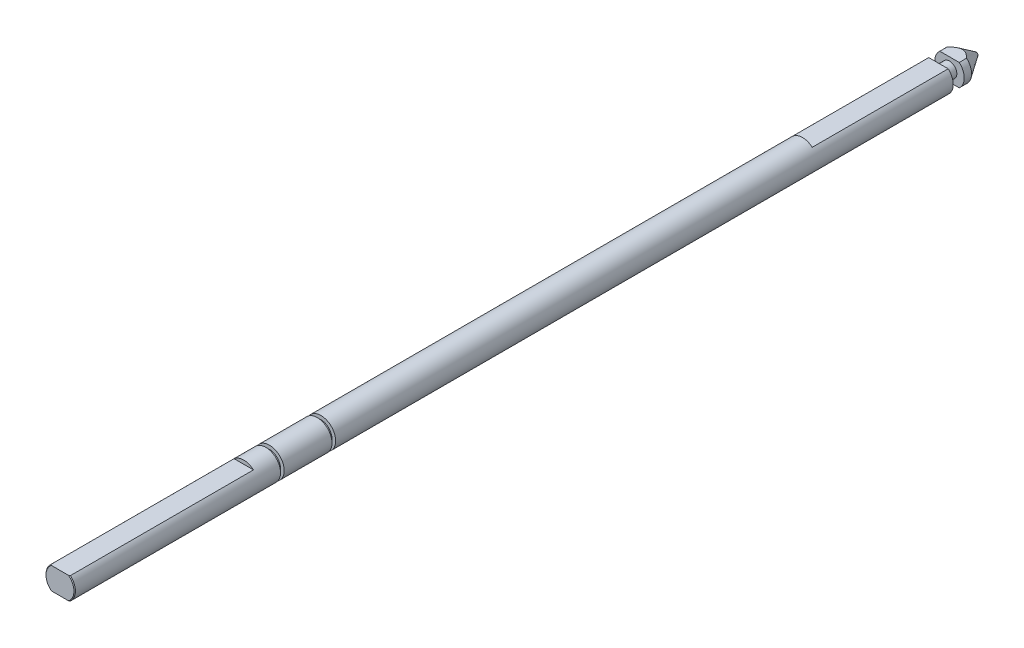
ISO-10303-21;
HEADER;
FILE_DESCRIPTION(('STEP AP214'),'2;1');
FILE_NAME('part.step','',(''),(''),'','','');
FILE_SCHEMA(('AUTOMOTIVE_DESIGN { 1 0 10303 214 1 1 1 1 }'));
ENDSEC;
DATA;
#1=APPLICATION_CONTEXT('core data for automotive mechanical design processes');
#2=APPLICATION_PROTOCOL_DEFINITION('international standard','automotive_design',2000,#1);
#3=PRODUCT_CONTEXT('',#1,'mechanical');
#4=PRODUCT('Part','Part','',(#3));
#5=PRODUCT_RELATED_PRODUCT_CATEGORY('part','',(#4));
#6=PRODUCT_DEFINITION_FORMATION('','',#4);
#7=PRODUCT_DEFINITION_CONTEXT('part definition',#1,'design');
#8=PRODUCT_DEFINITION('design','',#6,#7);
#9=PRODUCT_DEFINITION_SHAPE('','',#8);
#10=(LENGTH_UNIT() NAMED_UNIT(*) SI_UNIT(.MILLI.,.METRE.));
#11=(NAMED_UNIT(*) PLANE_ANGLE_UNIT() SI_UNIT($,.RADIAN.));
#12=(NAMED_UNIT(*) SI_UNIT($,.STERADIAN.) SOLID_ANGLE_UNIT());
#13=UNCERTAINTY_MEASURE_WITH_UNIT(LENGTH_MEASURE(1.E-05),#10,'distance_accuracy_value','');
#14=(GEOMETRIC_REPRESENTATION_CONTEXT(3) GLOBAL_UNCERTAINTY_ASSIGNED_CONTEXT((#13)) GLOBAL_UNIT_ASSIGNED_CONTEXT((#10,
#11,#12)) REPRESENTATION_CONTEXT('',''));
#15=CARTESIAN_POINT('',(0.,0.,0.));
#16=DIRECTION('',(0.,0.,1.));
#17=DIRECTION('',(1.,0.,0.));
#18=AXIS2_PLACEMENT_3D('',#15,#16,#17);
#19=CARTESIAN_POINT('',(0.,0.,125.));
#20=DIRECTION('',(0.,0.,-1.));
#21=DIRECTION('',(-1.,0.,0.));
#22=AXIS2_PLACEMENT_3D('',#19,#20,#21);
#23=CYLINDRICAL_SURFACE('',#22,2.);
#24=CARTESIAN_POINT('',(0.,0.,4.));
#25=DIRECTION('',(0.,0.,-1.));
#26=DIRECTION('',(-1.,0.,0.));
#27=AXIS2_PLACEMENT_3D('',#24,#25,#26);
#28=CIRCLE('',#27,2.);
#29=CARTESIAN_POINT('',(1.32287565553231,1.49999999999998,4.));
#30=VERTEX_POINT('',#29);
#31=CARTESIAN_POINT('',(1.32287565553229,-1.5,4.));
#32=VERTEX_POINT('',#31);
#33=EDGE_CURVE('E286',#30,#32,#28,.T.);
#34=ORIENTED_EDGE('',*,*,#33,.T.);
#35=DIRECTION('',(0.,0.,-1.));
#36=VECTOR('',#35,1.);
#37=CARTESIAN_POINT('',(1.32287565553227,-1.50000000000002,125.));
#38=LINE('',#37,#36);
#39=CARTESIAN_POINT('',(1.32287565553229,-1.5,3.));
#40=VERTEX_POINT('',#39);
#41=EDGE_CURVE('E43',#32,#40,#38,.T.);
#42=ORIENTED_EDGE('',*,*,#41,.T.);
#43=CARTESIAN_POINT('',(0.,0.,3.));
#44=DIRECTION('',(0.,0.,-1.));
#45=DIRECTION('',(-1.,0.,0.));
#46=AXIS2_PLACEMENT_3D('',#43,#44,#45);
#47=CIRCLE('',#46,2.);
#48=CARTESIAN_POINT('',(1.32287565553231,1.49999999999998,3.));
#49=VERTEX_POINT('',#48);
#50=EDGE_CURVE('E306',#49,#40,#47,.T.);
#51=ORIENTED_EDGE('',*,*,#50,.F.);
#52=DIRECTION('',(0.,0.,-1.));
#53=VECTOR('',#52,1.);
#54=CARTESIAN_POINT('',(1.32287565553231,1.49999999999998,125.));
#55=LINE('',#54,#53);
#56=EDGE_CURVE('E292',#49,#30,#55,.F.);
#57=ORIENTED_EDGE('',*,*,#56,.T.);
#58=EDGE_LOOP('',(#34,#42,#51,#57));
#59=FACE_BOUND('',#58,.T.);
#60=ADVANCED_FACE('F34',(#59),#23,.T.);
#61=CARTESIAN_POINT('',(0.,0.,24.));
#62=DIRECTION('',(0.,0.,1.));
#63=DIRECTION('',(0.,-1.,0.));
#64=AXIS2_PLACEMENT_3D('',#61,#62,#63);
#65=CIRCLE('',#64,2.);
#66=CARTESIAN_POINT('',(-1.32287565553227,-1.5,24.));
#67=VERTEX_POINT('',#66);
#68=CARTESIAN_POINT('',(1.32287565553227,-1.5,24.));
#69=VERTEX_POINT('',#68);
#70=EDGE_CURVE('E11',#67,#69,#65,.T.);
#71=ORIENTED_EDGE('',*,*,#70,.T.);
#72=DIRECTION('',(0.,0.,-1.));
#73=VECTOR('',#72,1.);
#74=CARTESIAN_POINT('',(1.32287565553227,-1.50000000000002,125.));
#75=LINE('',#74,#73);
#76=CARTESIAN_POINT('',(1.32287565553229,-1.5,5.50000000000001));
#77=VERTEX_POINT('',#76);
#78=EDGE_CURVE('E141',#69,#77,#75,.T.);
#79=ORIENTED_EDGE('',*,*,#78,.T.);
#80=CARTESIAN_POINT('',(0.,0.,5.50000000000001));
#81=DIRECTION('',(0.,0.,1.));
#82=DIRECTION('',(1.,0.,0.));
#83=AXIS2_PLACEMENT_3D('',#80,#81,#82);
#84=CIRCLE('',#83,2.);
#85=CARTESIAN_POINT('',(1.32287565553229,1.5,5.50000000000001));
#86=VERTEX_POINT('',#85);
#87=EDGE_CURVE('E288',#77,#86,#84,.T.);
#88=ORIENTED_EDGE('',*,*,#87,.T.);
#89=DIRECTION('',(0.,0.,-1.));
#90=VECTOR('',#89,1.);
#91=CARTESIAN_POINT('',(1.32287565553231,1.49999999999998,125.));
#92=LINE('',#91,#90);
#93=CARTESIAN_POINT('',(1.3228756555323,1.5,24.));
#94=VERTEX_POINT('',#93);
#95=EDGE_CURVE('E421',#86,#94,#92,.F.);
#96=ORIENTED_EDGE('',*,*,#95,.T.);
#97=CARTESIAN_POINT('',(0.,0.,24.));
#98=DIRECTION('',(0.,0.,1.));
#99=DIRECTION('',(1.,0.,0.));
#100=AXIS2_PLACEMENT_3D('',#97,#98,#99);
#101=CIRCLE('',#100,2.);
#102=CARTESIAN_POINT('',(-1.3228756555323,1.5,24.));
#103=VERTEX_POINT('',#102);
#104=EDGE_CURVE('E299',#94,#103,#101,.T.);
#105=ORIENTED_EDGE('',*,*,#104,.T.);
#106=DIRECTION('',(0.,0.,-1.));
#107=VECTOR('',#106,1.);
#108=CARTESIAN_POINT('',(-1.32287565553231,1.49999999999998,125.));
#109=LINE('',#108,#107);
#110=CARTESIAN_POINT('',(-1.32287565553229,1.5,5.50000000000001));
#111=VERTEX_POINT('',#110);
#112=EDGE_CURVE('E419',#103,#111,#109,.T.);
#113=ORIENTED_EDGE('',*,*,#112,.T.);
#114=CARTESIAN_POINT('',(-1.32287565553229,-1.5,5.50000000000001));
#115=VERTEX_POINT('',#114);
#116=EDGE_CURVE('E149',#111,#115,#84,.T.);
#117=ORIENTED_EDGE('',*,*,#116,.T.);
#118=DIRECTION('',(0.,0.,-1.));
#119=VECTOR('',#118,1.);
#120=CARTESIAN_POINT('',(-1.32287565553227,-1.50000000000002,125.));
#121=LINE('',#120,#119);
#122=EDGE_CURVE('E50',#115,#67,#121,.F.);
#123=ORIENTED_EDGE('',*,*,#122,.T.);
#124=EDGE_LOOP('',(#71,#79,#88,#96,#105,#113,#117,#123));
#125=FACE_BOUND('',#124,.T.);
#126=CARTESIAN_POINT('',(0.,0.,89.5));
#127=DIRECTION('',(0.,0.,1.));
#128=DIRECTION('',(1.,0.,0.));
#129=AXIS2_PLACEMENT_3D('',#126,#127,#128);
#130=CIRCLE('',#129,2.);
#131=CARTESIAN_POINT('',(2.,0.,89.5));
#132=VERTEX_POINT('',#131);
#133=EDGE_CURVE('E400',#132,#132,#130,.T.);
#134=ORIENTED_EDGE('',*,*,#133,.F.);
#135=EDGE_LOOP('',(#134));
#136=FACE_BOUND('',#135,.T.);
#137=ADVANCED_FACE('F145',(#125,#136),#23,.T.);
#138=CARTESIAN_POINT('',(0.,0.,90.));
#139=DIRECTION('',(0.,0.,-1.));
#140=DIRECTION('',(-1.,0.,0.));
#141=AXIS2_PLACEMENT_3D('',#138,#139,#140);
#142=CIRCLE('',#141,2.);
#143=CARTESIAN_POINT('',(-2.,0.,90.));
#144=VERTEX_POINT('',#143);
#145=EDGE_CURVE('E270',#144,#144,#142,.T.);
#146=ORIENTED_EDGE('',*,*,#145,.F.);
#147=EDGE_LOOP('',(#146));
#148=FACE_BOUND('',#147,.T.);
#149=CARTESIAN_POINT('',(0.,0.,96.5));
#150=DIRECTION('',(0.,0.,1.));
#151=DIRECTION('',(1.,0.,0.));
#152=AXIS2_PLACEMENT_3D('',#149,#150,#151);
#153=CIRCLE('',#152,2.);
#154=CARTESIAN_POINT('',(2.,0.,96.5));
#155=VERTEX_POINT('',#154);
#156=EDGE_CURVE('E273',#155,#155,#153,.T.);
#157=ORIENTED_EDGE('',*,*,#156,.F.);
#158=EDGE_LOOP('',(#157));
#159=FACE_BOUND('',#158,.T.);
#160=ADVANCED_FACE('F225',(#148,#159),#23,.T.);
#161=CARTESIAN_POINT('',(0.,1.5,89.5));
#162=DIRECTION('',(0.,0.,1.));
#163=DIRECTION('',(1.,0.,0.));
#164=AXIS2_PLACEMENT_3D('',#161,#162,#163);
#165=PLANE('',#164);
#166=CARTESIAN_POINT('',(0.,0.,89.5));
#167=DIRECTION('',(0.,0.,1.));
#168=DIRECTION('',(1.,0.,0.));
#169=AXIS2_PLACEMENT_3D('',#166,#167,#168);
#170=CIRCLE('',#169,1.5);
#171=CARTESIAN_POINT('',(1.5,0.,89.5));
#172=VERTEX_POINT('',#171);
#173=EDGE_CURVE('E275',#172,#172,#170,.T.);
#174=ORIENTED_EDGE('',*,*,#173,.F.);
#175=EDGE_LOOP('',(#174));
#176=FACE_BOUND('',#175,.T.);
#177=ORIENTED_EDGE('',*,*,#133,.T.);
#178=EDGE_LOOP('',(#177));
#179=FACE_BOUND('',#178,.T.);
#180=ADVANCED_FACE('F221',(#176,#179),#165,.T.);
#181=CARTESIAN_POINT('',(0.,1.5,90.));
#182=DIRECTION('',(0.,0.,-1.));
#183=DIRECTION('',(-1.,0.,0.));
#184=AXIS2_PLACEMENT_3D('',#181,#182,#183);
#185=PLANE('',#184);
#186=CARTESIAN_POINT('',(0.,0.,90.));
#187=DIRECTION('',(0.,0.,1.));
#188=DIRECTION('',(1.,0.,0.));
#189=AXIS2_PLACEMENT_3D('',#186,#187,#188);
#190=CIRCLE('',#189,1.5);
#191=CARTESIAN_POINT('',(1.5,0.,90.));
#192=VERTEX_POINT('',#191);
#193=EDGE_CURVE('E279',#192,#192,#190,.T.);
#194=ORIENTED_EDGE('',*,*,#193,.T.);
#195=EDGE_LOOP('',(#194));
#196=FACE_BOUND('',#195,.T.);
#197=ORIENTED_EDGE('',*,*,#145,.T.);
#198=EDGE_LOOP('',(#197));
#199=FACE_BOUND('',#198,.T.);
#200=ADVANCED_FACE('F217',(#196,#199),#185,.T.);
#201=CARTESIAN_POINT('',(0.,0.,129.9));
#202=DIRECTION('',(0.,0.,1.));
#203=DIRECTION('',(1.,0.,0.));
#204=AXIS2_PLACEMENT_3D('',#201,#202,#203);
#205=CYLINDRICAL_SURFACE('',#204,1.5);
#206=ORIENTED_EDGE('',*,*,#173,.T.);
#207=EDGE_LOOP('',(#206));
#208=FACE_BOUND('',#207,.T.);
#209=ORIENTED_EDGE('',*,*,#193,.F.);
#210=EDGE_LOOP('',(#209));
#211=FACE_BOUND('',#210,.T.);
#212=ADVANCED_FACE('F213',(#208,#211),#205,.T.);
#213=CARTESIAN_POINT('',(0.,3.36259698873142,96.5));
#214=DIRECTION('',(0.,0.,1.));
#215=DIRECTION('',(1.,0.,0.));
#216=AXIS2_PLACEMENT_3D('',#213,#214,#215);
#217=PLANE('',#216);
#218=CARTESIAN_POINT('',(0.,0.,96.5));
#219=DIRECTION('',(0.,0.,1.));
#220=DIRECTION('',(1.,0.,0.));
#221=AXIS2_PLACEMENT_3D('',#218,#219,#220);
#222=CIRCLE('',#221,1.5);
#223=CARTESIAN_POINT('',(1.5,0.,96.5));
#224=VERTEX_POINT('',#223);
#225=EDGE_CURVE('E282',#224,#224,#222,.T.);
#226=ORIENTED_EDGE('',*,*,#225,.F.);
#227=EDGE_LOOP('',(#226));
#228=FACE_BOUND('',#227,.T.);
#229=ORIENTED_EDGE('',*,*,#156,.T.);
#230=EDGE_LOOP('',(#229));
#231=FACE_BOUND('',#230,.T.);
#232=ADVANCED_FACE('F205',(#228,#231),#217,.T.);
#233=CARTESIAN_POINT('',(0.,3.36259698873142,97.));
#234=DIRECTION('',(0.,0.,-1.));
#235=DIRECTION('',(-1.,0.,0.));
#236=AXIS2_PLACEMENT_3D('',#233,#234,#235);
#237=PLANE('',#236);
#238=CARTESIAN_POINT('',(0.,0.,97.));
#239=DIRECTION('',(0.,0.,1.));
#240=DIRECTION('',(1.,0.,0.));
#241=AXIS2_PLACEMENT_3D('',#238,#239,#240);
#242=CIRCLE('',#241,1.5);
#243=CARTESIAN_POINT('',(1.5,0.,97.));
#244=VERTEX_POINT('',#243);
#245=EDGE_CURVE('E291',#244,#244,#242,.T.);
#246=ORIENTED_EDGE('',*,*,#245,.T.);
#247=EDGE_LOOP('',(#246));
#248=FACE_BOUND('',#247,.T.);
#249=CARTESIAN_POINT('',(0.,0.,97.));
#250=DIRECTION('',(0.,0.,-1.));
#251=DIRECTION('',(-1.,0.,0.));
#252=AXIS2_PLACEMENT_3D('',#249,#250,#251);
#253=CIRCLE('',#252,2.);
#254=CARTESIAN_POINT('',(-2.,0.,97.));
#255=VERTEX_POINT('',#254);
#256=EDGE_CURVE('E276',#255,#255,#253,.T.);
#257=ORIENTED_EDGE('',*,*,#256,.T.);
#258=EDGE_LOOP('',(#257));
#259=FACE_BOUND('',#258,.T.);
#260=ADVANCED_FACE('F201',(#248,#259),#237,.T.);
#261=CARTESIAN_POINT('',(0.,0.,129.9));
#262=DIRECTION('',(0.,0.,1.));
#263=DIRECTION('',(1.,0.,0.));
#264=AXIS2_PLACEMENT_3D('',#261,#262,#263);
#265=CYLINDRICAL_SURFACE('',#264,1.5);
#266=ORIENTED_EDGE('',*,*,#225,.T.);
#267=EDGE_LOOP('',(#266));
#268=FACE_BOUND('',#267,.T.);
#269=ORIENTED_EDGE('',*,*,#245,.F.);
#270=EDGE_LOOP('',(#269));
#271=FACE_BOUND('',#270,.T.);
#272=ADVANCED_FACE('F204',(#268,#271),#265,.T.);
#273=CARTESIAN_POINT('',(0.,0.,125.));
#274=DIRECTION('',(0.,0.,1.));
#275=DIRECTION('',(1.,0.,0.));
#276=AXIS2_PLACEMENT_3D('',#273,#274,#275);
#277=PLANE('',#276);
#278=DIRECTION('',(1.,0.,0.));
#279=VECTOR('',#278,1.);
#280=CARTESIAN_POINT('',(-5.,-1.5,125.));
#281=LINE('',#280,#279);
#282=CARTESIAN_POINT('',(-1.16619037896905,-1.5,125.));
#283=VERTEX_POINT('',#282);
#284=CARTESIAN_POINT('',(1.16619037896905,-1.5,125.));
#285=VERTEX_POINT('',#284);
#286=EDGE_CURVE('E315',#283,#285,#281,.T.);
#287=ORIENTED_EDGE('',*,*,#286,.T.);
#288=CARTESIAN_POINT('',(0.,0.,125.));
#289=DIRECTION('',(0.,0.,1.));
#290=DIRECTION('',(1.,0.,0.));
#291=AXIS2_PLACEMENT_3D('',#288,#289,#290);
#292=CIRCLE('',#291,1.9);
#293=CARTESIAN_POINT('',(1.16619037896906,1.5,125.));
#294=VERTEX_POINT('',#293);
#295=EDGE_CURVE('E342',#285,#294,#292,.T.);
#296=ORIENTED_EDGE('',*,*,#295,.T.);
#297=DIRECTION('',(1.,0.,0.));
#298=VECTOR('',#297,1.);
#299=CARTESIAN_POINT('',(-5.,1.5,125.));
#300=LINE('',#299,#298);
#301=CARTESIAN_POINT('',(-1.16619037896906,1.5,125.));
#302=VERTEX_POINT('',#301);
#303=EDGE_CURVE('E330',#302,#294,#300,.T.);
#304=ORIENTED_EDGE('',*,*,#303,.F.);
#305=EDGE_CURVE('E343',#302,#283,#292,.T.);
#306=ORIENTED_EDGE('',*,*,#305,.T.);
#307=EDGE_LOOP('',(#287,#296,#304,#306));
#308=FACE_BOUND('',#307,.T.);
#309=ADVANCED_FACE('F209',(#308),#277,.T.);
#310=CARTESIAN_POINT('',(-5.,11.5,100.));
#311=DIRECTION('',(0.,0.,-1.));
#312=DIRECTION('',(-1.,0.,0.));
#313=AXIS2_PLACEMENT_3D('',#310,#311,#312);
#314=PLANE('',#313);
#315=DIRECTION('',(1.,0.,0.));
#316=VECTOR('',#315,1.);
#317=CARTESIAN_POINT('',(-5.,1.5,100.));
#318=LINE('',#317,#316);
#319=CARTESIAN_POINT('',(-1.3228756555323,1.5,100.));
#320=VERTEX_POINT('',#319);
#321=CARTESIAN_POINT('',(1.3228756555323,1.5,100.));
#322=VERTEX_POINT('',#321);
#323=EDGE_CURVE('E331',#320,#322,#318,.T.);
#324=ORIENTED_EDGE('',*,*,#323,.T.);
#325=CARTESIAN_POINT('',(0.,0.,100.));
#326=DIRECTION('',(0.,0.,-1.));
#327=DIRECTION('',(-1.,0.,0.));
#328=AXIS2_PLACEMENT_3D('',#325,#326,#327);
#329=CIRCLE('',#328,2.);
#330=EDGE_CURVE('E357',#320,#322,#329,.T.);
#331=ORIENTED_EDGE('',*,*,#330,.F.);
#332=EDGE_LOOP('',(#324,#331));
#333=FACE_BOUND('',#332,.T.);
#334=ADVANCED_FACE('F364',(#333),#314,.F.);
#335=CARTESIAN_POINT('',(-5.,1.5,100.));
#336=DIRECTION('',(0.,-1.,0.));
#337=DIRECTION('',(0.,0.,-1.));
#338=AXIS2_PLACEMENT_3D('',#335,#336,#337);
#339=PLANE('',#338);
#340=CARTESIAN_POINT('',(-4.13743397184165,1.5,122.499050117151));
#341=CARTESIAN_POINT('',(-4.00723225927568,1.5,122.62142077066));
#342=CARTESIAN_POINT('',(-3.87672683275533,1.5,122.743472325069));
#343=CARTESIAN_POINT('',(-3.61473614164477,1.5,122.986706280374));
#344=CARTESIAN_POINT('',(-3.48325024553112,1.5,123.10788800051));
#345=CARTESIAN_POINT('',(-3.21572782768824,1.5,123.352063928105));
#346=CARTESIAN_POINT('',(-3.07966101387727,1.5,123.475025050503));
#347=CARTESIAN_POINT('',(-2.80588908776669,1.5,123.718939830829));
#348=CARTESIAN_POINT('',(-2.66818505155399,1.5,123.839894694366));
#349=CARTESIAN_POINT('',(-2.39036554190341,1.5,124.078869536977));
#350=CARTESIAN_POINT('',(-2.2502514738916,1.5,124.196891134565));
#351=CARTESIAN_POINT('',(-2.037092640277,1.5,124.370559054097));
#352=CARTESIAN_POINT('',(-1.96546717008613,1.5,124.42794441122));
#353=CARTESIAN_POINT('',(-1.82101103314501,1.5,124.541173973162));
#354=CARTESIAN_POINT('',(-1.74818044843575,1.5,124.597018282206));
#355=CARTESIAN_POINT('',(-1.60175753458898,1.5,124.706084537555));
#356=CARTESIAN_POINT('',(-1.52818118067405,1.5,124.759327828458));
#357=CARTESIAN_POINT('',(-1.37907549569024,1.5,124.863096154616));
#358=CARTESIAN_POINT('',(-1.30354539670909,1.5,124.913620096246));
#359=CARTESIAN_POINT('',(-1.15029190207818,1.5,125.010645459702));
#360=CARTESIAN_POINT('',(-1.0725770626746,1.5,125.057160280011));
#361=CARTESIAN_POINT('',(-0.914115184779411,1.5,125.144653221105));
#362=CARTESIAN_POINT('',(-0.833371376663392,1.5,125.185637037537));
#363=CARTESIAN_POINT('',(-0.705122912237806,1.5,125.243033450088));
#364=CARTESIAN_POINT('',(-0.658875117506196,1.5,125.262246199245));
#365=CARTESIAN_POINT('',(-0.565207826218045,1.5,125.297633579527));
#366=CARTESIAN_POINT('',(-0.517788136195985,1.5,125.31380770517));
#367=CARTESIAN_POINT('',(-0.422103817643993,1.5,125.342405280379));
#368=CARTESIAN_POINT('',(-0.373845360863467,1.5,125.354849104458));
#369=CARTESIAN_POINT('',(-0.276431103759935,1.5,125.375483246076));
#370=CARTESIAN_POINT('',(-0.227275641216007,1.5,125.383675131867));
#371=CARTESIAN_POINT('',(-0.127717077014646,1.5,125.395394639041));
#372=CARTESIAN_POINT('',(-0.0773061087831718,1.5,125.398856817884));
#373=CARTESIAN_POINT('',(0.0236044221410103,1.5,125.400662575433));
#374=CARTESIAN_POINT('',(0.0741039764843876,1.5,125.399006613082));
#375=CARTESIAN_POINT('',(0.174855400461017,1.5,125.390680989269));
#376=CARTESIAN_POINT('',(0.225105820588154,1.5,125.383994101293));
#377=CARTESIAN_POINT('',(0.324776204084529,1.5,125.366027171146));
#378=CARTESIAN_POINT('',(0.374195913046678,1.5,125.354745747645));
#379=CARTESIAN_POINT('',(0.489469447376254,1.5,125.323454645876));
#380=CARTESIAN_POINT('',(0.554864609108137,1.5,125.301765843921));
#381=CARTESIAN_POINT('',(0.683468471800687,1.5,125.252703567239));
#382=CARTESIAN_POINT('',(0.746675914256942,1.5,125.22532688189));
#383=CARTESIAN_POINT('',(0.871745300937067,1.5,125.165965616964));
#384=CARTESIAN_POINT('',(0.9335838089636,1.5,125.133932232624));
#385=CARTESIAN_POINT('',(1.02495606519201,1.5,125.083439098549));
#386=CARTESIAN_POINT('',(1.05517882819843,1.5,125.06620321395));
#387=CARTESIAN_POINT('',(1.11520505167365,1.5,125.031018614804));
#388=CARTESIAN_POINT('',(1.14500853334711,1.5,125.013069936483));
#389=CARTESIAN_POINT('',(1.24756406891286,1.5,124.949844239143));
#390=CARTESIAN_POINT('',(1.3193544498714,1.5,124.903005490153));
#391=CARTESIAN_POINT('',(1.4611148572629,1.5,124.806638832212));
#392=CARTESIAN_POINT('',(1.53108434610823,1.5,124.757110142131));
#393=CARTESIAN_POINT('',(1.66963311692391,1.5,124.656023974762));
#394=CARTESIAN_POINT('',(1.73821109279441,1.5,124.604464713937));
#395=CARTESIAN_POINT('',(1.87420899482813,1.5,124.499837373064));
#396=CARTESIAN_POINT('',(1.94162883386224,1.5,124.446769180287));
#397=CARTESIAN_POINT('',(2.14304711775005,1.5,124.285401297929));
#398=CARTESIAN_POINT('',(2.27564470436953,1.5,124.175355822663));
#399=CARTESIAN_POINT('',(2.53829178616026,1.5,123.952432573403));
#400=CARTESIAN_POINT('',(2.66834259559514,1.5,123.839556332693));
#401=CARTESIAN_POINT('',(2.91156653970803,1.5,123.625198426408));
#402=CARTESIAN_POINT('',(3.02493046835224,1.5,123.523932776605));
#403=CARTESIAN_POINT('',(3.25066692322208,1.5,123.320269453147));
#404=CARTESIAN_POINT('',(3.36303929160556,1.5,123.217871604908));
#405=CARTESIAN_POINT('',(3.58609270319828,1.5,123.013083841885));
#406=CARTESIAN_POINT('',(3.69678005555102,1.5,122.910700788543));
#407=CARTESIAN_POINT('',(3.91753069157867,1.5,122.705307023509));
#408=CARTESIAN_POINT('',(4.02759409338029,1.5,122.602296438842));
#409=CARTESIAN_POINT('',(4.13743397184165,1.5,122.499050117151));
#410=B_SPLINE_CURVE_WITH_KNOTS('',3,(#340,#341,#342,#343,#344,#345,#346,#347,#348,#349,#350,
#351,#352,#353,#354,#355,#356,#357,#358,#359,#360,#361,#362,#363,#364,#365,#366,#367,#368,#369,
#370,#371,#372,#373,#374,#375,#376,#377,#378,#379,#380,#381,#382,#383,#384,#385,#386,#387,#388,
#389,#390,#391,#392,#393,#394,#395,#396,#397,#398,#399,#400,#401,#402,#403,#404,#405,#406,#407,
#408,#409),.UNSPECIFIED.,.F.,.F.,(4,2,2,2,2,2,2,2,2,2,2,2,2,2,2,2,2,2,2,2,2,2,2,2,2,2,2,2,2,2,2,
2,2,2,4),(0.,0.536047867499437,1.0724774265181,1.62264777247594,2.17247456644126,
2.72199092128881,2.99731119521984,3.27261280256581,3.54503007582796,3.81755609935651,
4.08913284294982,4.36042775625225,4.51058337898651,4.66076395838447,4.81010866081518,
4.95939824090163,5.1107332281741,5.26205464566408,5.41389657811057,5.56578419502,
5.77211362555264,5.97855984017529,6.18735087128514,6.2917199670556,6.39608376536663,
6.65314355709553,6.91027839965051,7.16764436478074,7.42502960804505,7.94189340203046,
8.45848303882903,8.91449375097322,9.37057578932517,9.82290671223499,10.2751489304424),.UNSPECIFIED.);
#411=CARTESIAN_POINT('',(-1.3228756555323,1.5,124.9));
#412=VERTEX_POINT('',#411);
#413=EDGE_CURVE('E356',#412,#302,#410,.T.);
#414=ORIENTED_EDGE('',*,*,#413,.T.);
#415=ORIENTED_EDGE('',*,*,#303,.T.);
#416=CARTESIAN_POINT('',(1.3228756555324,1.5,124.9));
#417=VERTEX_POINT('',#416);
#418=EDGE_CURVE('E349',#294,#417,#410,.T.);
#419=ORIENTED_EDGE('',*,*,#418,.T.);
#420=DIRECTION('',(0.,0.,-1.));
#421=VECTOR('',#420,1.);
#422=CARTESIAN_POINT('',(1.3228756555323,1.5,125.));
#423=LINE('',#422,#421);
#424=EDGE_CURVE('E334',#322,#417,#423,.F.);
#425=ORIENTED_EDGE('',*,*,#424,.F.);
#426=ORIENTED_EDGE('',*,*,#323,.F.);
#427=DIRECTION('',(0.,0.,-1.));
#428=VECTOR('',#427,1.);
#429=CARTESIAN_POINT('',(-1.3228756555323,1.5,125.));
#430=LINE('',#429,#428);
#431=EDGE_CURVE('E339',#412,#320,#430,.T.);
#432=ORIENTED_EDGE('',*,*,#431,.F.);
#433=EDGE_LOOP('',(#414,#415,#419,#425,#426,#432));
#434=FACE_BOUND('',#433,.T.);
#435=ADVANCED_FACE('F359',(#434),#339,.F.);
#436=CARTESIAN_POINT('',(0.,0.,125.));
#437=DIRECTION('',(0.,0.,-1.));
#438=DIRECTION('',(-1.,0.,0.));
#439=AXIS2_PLACEMENT_3D('',#436,#437,#438);
#440=CONICAL_SURFACE('',#439,1.9,0.785398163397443);
#441=CARTESIAN_POINT('',(4.13743397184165,-1.5,122.499050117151));
#442=CARTESIAN_POINT('',(4.00723225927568,-1.5,122.62142077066));
#443=CARTESIAN_POINT('',(3.87672683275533,-1.5,122.743472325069));
#444=CARTESIAN_POINT('',(3.61473614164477,-1.5,122.986706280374));
#445=CARTESIAN_POINT('',(3.48325024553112,-1.5,123.10788800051));
#446=CARTESIAN_POINT('',(3.21572782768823,-1.5,123.352063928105));
#447=CARTESIAN_POINT('',(3.07966101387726,-1.5,123.475025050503));
#448=CARTESIAN_POINT('',(2.80588908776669,-1.5,123.718939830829));
#449=CARTESIAN_POINT('',(2.66818505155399,-1.5,123.839894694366));
#450=CARTESIAN_POINT('',(2.39036554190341,-1.5,124.078869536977));
#451=CARTESIAN_POINT('',(2.2502514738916,-1.5,124.196891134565));
#452=CARTESIAN_POINT('',(2.03709264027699,-1.5,124.370559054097));
#453=CARTESIAN_POINT('',(1.96546717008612,-1.5,124.42794441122));
#454=CARTESIAN_POINT('',(1.821011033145,-1.5,124.541173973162));
#455=CARTESIAN_POINT('',(1.74818044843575,-1.5,124.597018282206));
#456=CARTESIAN_POINT('',(1.60175753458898,-1.5,124.706084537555));
#457=CARTESIAN_POINT('',(1.52818118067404,-1.5,124.759327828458));
#458=CARTESIAN_POINT('',(1.37907549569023,-1.5,124.863096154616));
#459=CARTESIAN_POINT('',(1.30354539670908,-1.5,124.913620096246));
#460=CARTESIAN_POINT('',(1.15029190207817,-1.5,125.010645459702));
#461=CARTESIAN_POINT('',(1.07257706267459,-1.5,125.057160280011));
#462=CARTESIAN_POINT('',(0.914115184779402,-1.5,125.144653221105));
#463=CARTESIAN_POINT('',(0.833371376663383,-1.5,125.185637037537));
#464=CARTESIAN_POINT('',(0.705122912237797,-1.5,125.243033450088));
#465=CARTESIAN_POINT('',(0.658875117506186,-1.5,125.262246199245));
#466=CARTESIAN_POINT('',(0.565207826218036,-1.5,125.297633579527));
#467=CARTESIAN_POINT('',(0.517788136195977,-1.5,125.31380770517));
#468=CARTESIAN_POINT('',(0.422103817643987,-1.5,125.342405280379));
#469=CARTESIAN_POINT('',(0.373845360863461,-1.5,125.354849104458));
#470=CARTESIAN_POINT('',(0.276431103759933,-1.5,125.375483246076));
#471=CARTESIAN_POINT('',(0.227275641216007,-1.5,125.383675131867));
#472=CARTESIAN_POINT('',(0.127717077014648,-1.5,125.395394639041));
#473=CARTESIAN_POINT('',(0.0773061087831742,-1.5,125.398856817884));
#474=CARTESIAN_POINT('',(-0.0236044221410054,-1.5,125.400662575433));
#475=CARTESIAN_POINT('',(-0.0741039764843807,-1.5,125.399006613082));
#476=CARTESIAN_POINT('',(-0.174855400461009,-1.5,125.390680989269));
#477=CARTESIAN_POINT('',(-0.225105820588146,-1.5,125.383994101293));
#478=CARTESIAN_POINT('',(-0.324776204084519,-1.5,125.366027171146));
#479=CARTESIAN_POINT('',(-0.374195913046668,-1.5,125.354745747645));
#480=CARTESIAN_POINT('',(-0.489469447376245,-1.5,125.323454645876));
#481=CARTESIAN_POINT('',(-0.554864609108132,-1.5,125.301765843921));
#482=CARTESIAN_POINT('',(-0.68346847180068,-1.5,125.252703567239));
#483=CARTESIAN_POINT('',(-0.746675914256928,-1.5,125.22532688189));
#484=CARTESIAN_POINT('',(-0.871745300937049,-1.5,125.165965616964));
#485=CARTESIAN_POINT('',(-0.933583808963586,-1.5,125.133932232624));
#486=CARTESIAN_POINT('',(-1.02495606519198,-1.5,125.083439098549));
#487=CARTESIAN_POINT('',(-1.05517882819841,-1.5,125.06620321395));
#488=CARTESIAN_POINT('',(-1.11520505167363,-1.5,125.031018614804));
#489=CARTESIAN_POINT('',(-1.14500853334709,-1.5,125.013069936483));
#490=CARTESIAN_POINT('',(-1.24756406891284,-1.5,124.949844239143));
#491=CARTESIAN_POINT('',(-1.31935444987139,-1.5,124.903005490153));
#492=CARTESIAN_POINT('',(-1.46111485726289,-1.5,124.806638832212));
#493=CARTESIAN_POINT('',(-1.53108434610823,-1.5,124.757110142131));
#494=CARTESIAN_POINT('',(-1.6696331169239,-1.5,124.656023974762));
#495=CARTESIAN_POINT('',(-1.7382110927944,-1.5,124.604464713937));
#496=CARTESIAN_POINT('',(-1.87420899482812,-1.5,124.499837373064));
#497=CARTESIAN_POINT('',(-1.94162883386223,-1.5,124.446769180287));
#498=CARTESIAN_POINT('',(-2.14304711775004,-1.5,124.285401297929));
#499=CARTESIAN_POINT('',(-2.27564470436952,-1.5,124.175355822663));
#500=CARTESIAN_POINT('',(-2.53829178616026,-1.5,123.952432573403));
#501=CARTESIAN_POINT('',(-2.66834259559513,-1.5,123.839556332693));
#502=CARTESIAN_POINT('',(-2.91156653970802,-1.5,123.625198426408));
#503=CARTESIAN_POINT('',(-3.02493046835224,-1.5,123.523932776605));
#504=CARTESIAN_POINT('',(-3.25066692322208,-1.5,123.320269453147));
#505=CARTESIAN_POINT('',(-3.36303929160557,-1.5,123.217871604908));
#506=CARTESIAN_POINT('',(-3.58609270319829,-1.5,123.013083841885));
#507=CARTESIAN_POINT('',(-3.69678005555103,-1.5,122.910700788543));
#508=CARTESIAN_POINT('',(-3.91753069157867,-1.5,122.705307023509));
#509=CARTESIAN_POINT('',(-4.02759409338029,-1.5,122.602296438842));
#510=CARTESIAN_POINT('',(-4.13743397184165,-1.5,122.499050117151));
#511=B_SPLINE_CURVE_WITH_KNOTS('',3,(#441,#442,#443,#444,#445,#446,#447,#448,#449,#450,#451,
#452,#453,#454,#455,#456,#457,#458,#459,#460,#461,#462,#463,#464,#465,#466,#467,#468,#469,#470,
#471,#472,#473,#474,#475,#476,#477,#478,#479,#480,#481,#482,#483,#484,#485,#486,#487,#488,#489,
#490,#491,#492,#493,#494,#495,#496,#497,#498,#499,#500,#501,#502,#503,#504,#505,#506,#507,#508,
#509,#510),.UNSPECIFIED.,.F.,.F.,(4,2,2,2,2,2,2,2,2,2,2,2,2,2,2,2,2,2,2,2,2,2,2,2,2,2,2,2,2,2,2,
2,2,2,4),(0.,0.536047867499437,1.0724774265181,1.62264777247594,2.17247456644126,
2.72199092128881,2.99731119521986,3.27261280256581,3.54503007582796,3.81755609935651,
4.08913284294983,4.36042775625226,4.51058337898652,4.66076395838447,4.81010866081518,
4.95939824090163,5.11073322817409,5.26205464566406,5.41389657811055,5.56578419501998,
5.77211362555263,5.97855984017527,6.18735087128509,6.29171996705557,6.3960837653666,
6.65314355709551,6.91027839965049,7.16764436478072,7.42502960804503,7.94189340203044,
8.45848303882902,8.91449375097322,9.37057578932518,9.82290671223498,10.2751489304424),.UNSPECIFIED.);
#512=CARTESIAN_POINT('',(-1.32287565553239,-1.5,124.9));
#513=VERTEX_POINT('',#512);
#514=EDGE_CURVE('E385',#283,#513,#511,.T.);
#515=ORIENTED_EDGE('',*,*,#514,.F.);
#516=ORIENTED_EDGE('',*,*,#305,.F.);
#517=ORIENTED_EDGE('',*,*,#413,.F.);
#518=CARTESIAN_POINT('',(0.,0.,124.9));
#519=DIRECTION('',(0.,0.,1.));
#520=DIRECTION('',(1.,0.,0.));
#521=AXIS2_PLACEMENT_3D('',#518,#519,#520);
#522=CIRCLE('',#521,2.);
#523=EDGE_CURVE('E346',#513,#412,#522,.F.);
#524=ORIENTED_EDGE('',*,*,#523,.F.);
#525=EDGE_LOOP('',(#515,#516,#517,#524));
#526=FACE_BOUND('',#525,.T.);
#527=ADVANCED_FACE('F36',(#526),#440,.T.);
#528=CARTESIAN_POINT('',(-5.,-1.5,100.));
#529=DIRECTION('',(0.,0.,-1.));
#530=DIRECTION('',(-1.,0.,0.));
#531=AXIS2_PLACEMENT_3D('',#528,#529,#530);
#532=PLANE('',#531);
#533=DIRECTION('',(1.,0.,0.));
#534=VECTOR('',#533,1.);
#535=CARTESIAN_POINT('',(-5.,-1.5,100.));
#536=LINE('',#535,#534);
#537=CARTESIAN_POINT('',(-1.32287565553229,-1.5,100.));
#538=VERTEX_POINT('',#537);
#539=CARTESIAN_POINT('',(1.32287565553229,-1.5,100.));
#540=VERTEX_POINT('',#539);
#541=EDGE_CURVE('E311',#538,#540,#536,.T.);
#542=ORIENTED_EDGE('',*,*,#541,.F.);
#543=CARTESIAN_POINT('',(0.,0.,100.));
#544=DIRECTION('',(0.,0.,-1.));
#545=DIRECTION('',(-1.,0.,0.));
#546=AXIS2_PLACEMENT_3D('',#543,#544,#545);
#547=CIRCLE('',#546,2.);
#548=EDGE_CURVE('E296',#540,#538,#547,.T.);
#549=ORIENTED_EDGE('',*,*,#548,.F.);
#550=EDGE_LOOP('',(#542,#549));
#551=FACE_BOUND('',#550,.T.);
#552=ADVANCED_FACE('F366',(#551),#532,.F.);
#553=CARTESIAN_POINT('',(-5.,-1.5,125.));
#554=DIRECTION('',(0.,1.,0.));
#555=DIRECTION('',(0.,0.,1.));
#556=AXIS2_PLACEMENT_3D('',#553,#554,#555);
#557=PLANE('',#556);
#558=CARTESIAN_POINT('',(1.32287565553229,-1.5,124.9));
#559=VERTEX_POINT('',#558);
#560=EDGE_CURVE('E381',#559,#285,#511,.T.);
#561=ORIENTED_EDGE('',*,*,#560,.T.);
#562=ORIENTED_EDGE('',*,*,#286,.F.);
#563=ORIENTED_EDGE('',*,*,#514,.T.);
#564=DIRECTION('',(0.,0.,-1.));
#565=VECTOR('',#564,1.);
#566=CARTESIAN_POINT('',(-1.32287565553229,-1.5,125.));
#567=LINE('',#566,#565);
#568=EDGE_CURVE('E323',#538,#513,#567,.F.);
#569=ORIENTED_EDGE('',*,*,#568,.F.);
#570=ORIENTED_EDGE('',*,*,#541,.T.);
#571=DIRECTION('',(0.,0.,-1.));
#572=VECTOR('',#571,1.);
#573=CARTESIAN_POINT('',(1.32287565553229,-1.5,125.));
#574=LINE('',#573,#572);
#575=EDGE_CURVE('E327',#559,#540,#574,.T.);
#576=ORIENTED_EDGE('',*,*,#575,.F.);
#577=EDGE_LOOP('',(#561,#562,#563,#569,#570,#576));
#578=FACE_BOUND('',#577,.T.);
#579=ADVANCED_FACE('F259',(#578),#557,.F.);
#580=ORIENTED_EDGE('',*,*,#560,.F.);
#581=EDGE_CURVE('E347',#417,#559,#522,.F.);
#582=ORIENTED_EDGE('',*,*,#581,.F.);
#583=ORIENTED_EDGE('',*,*,#418,.F.);
#584=ORIENTED_EDGE('',*,*,#295,.F.);
#585=EDGE_LOOP('',(#580,#582,#583,#584));
#586=FACE_BOUND('',#585,.T.);
#587=ADVANCED_FACE('F254',(#586),#440,.T.);
#588=ORIENTED_EDGE('',*,*,#581,.T.);
#589=ORIENTED_EDGE('',*,*,#575,.T.);
#590=ORIENTED_EDGE('',*,*,#548,.T.);
#591=ORIENTED_EDGE('',*,*,#568,.T.);
#592=ORIENTED_EDGE('',*,*,#523,.T.);
#593=ORIENTED_EDGE('',*,*,#431,.T.);
#594=ORIENTED_EDGE('',*,*,#330,.T.);
#595=ORIENTED_EDGE('',*,*,#424,.T.);
#596=EDGE_LOOP('',(#588,#589,#590,#591,#592,#593,#594,#595));
#597=FACE_BOUND('',#596,.T.);
#598=ORIENTED_EDGE('',*,*,#256,.F.);
#599=EDGE_LOOP('',(#598));
#600=FACE_BOUND('',#599,.T.);
#601=ADVANCED_FACE('F199',(#597,#600),#23,.T.);
#602=CARTESIAN_POINT('',(0.,11.,5.5));
#603=DIRECTION('',(0.,0.,1.));
#604=DIRECTION('',(1.,0.,0.));
#605=AXIS2_PLACEMENT_3D('',#602,#603,#604);
#606=PLANE('',#605);
#607=CARTESIAN_POINT('',(0.,0.,5.5));
#608=DIRECTION('',(0.,0.,-1.));
#609=DIRECTION('',(-1.,0.,0.));
#610=AXIS2_PLACEMENT_3D('',#607,#608,#609);
#611=CIRCLE('',#610,1.);
#612=CARTESIAN_POINT('',(-1.,0.,5.5));
#613=VERTEX_POINT('',#612);
#614=EDGE_CURVE('E416',#613,#613,#611,.T.);
#615=ORIENTED_EDGE('',*,*,#614,.F.);
#616=EDGE_LOOP('',(#615));
#617=FACE_BOUND('',#616,.T.);
#618=ORIENTED_EDGE('',*,*,#87,.F.);
#619=DIRECTION('',(-1.,0.,0.));
#620=VECTOR('',#619,1.);
#621=CARTESIAN_POINT('',(0.,-1.5,5.5));
#622=LINE('',#621,#620);
#623=EDGE_CURVE('E150',#77,#115,#622,.T.);
#624=ORIENTED_EDGE('',*,*,#623,.T.);
#625=ORIENTED_EDGE('',*,*,#116,.F.);
#626=DIRECTION('',(1.,0.,0.));
#627=VECTOR('',#626,1.);
#628=CARTESIAN_POINT('',(0.,1.5,5.5));
#629=LINE('',#628,#627);
#630=EDGE_CURVE('E423',#111,#86,#629,.T.);
#631=ORIENTED_EDGE('',*,*,#630,.T.);
#632=EDGE_LOOP('',(#618,#624,#625,#631));
#633=FACE_BOUND('',#632,.T.);
#634=ADVANCED_FACE('F195',(#617,#633),#606,.F.);
#635=CARTESIAN_POINT('',(0.,11.,4.));
#636=DIRECTION('',(0.,0.,-1.));
#637=DIRECTION('',(-1.,0.,0.));
#638=AXIS2_PLACEMENT_3D('',#635,#636,#637);
#639=PLANE('',#638);
#640=CARTESIAN_POINT('',(0.,0.,4.));
#641=DIRECTION('',(0.,0.,-1.));
#642=DIRECTION('',(-1.,0.,0.));
#643=AXIS2_PLACEMENT_3D('',#640,#641,#642);
#644=CIRCLE('',#643,1.);
#645=CARTESIAN_POINT('',(-1.,0.,4.));
#646=VERTEX_POINT('',#645);
#647=EDGE_CURVE('E413',#646,#646,#644,.T.);
#648=ORIENTED_EDGE('',*,*,#647,.T.);
#649=EDGE_LOOP('',(#648));
#650=FACE_BOUND('',#649,.T.);
#651=CARTESIAN_POINT('',(-1.32287565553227,-1.50000000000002,4.));
#652=VERTEX_POINT('',#651);
#653=CARTESIAN_POINT('',(-1.32287565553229,1.5,4.));
#654=VERTEX_POINT('',#653);
#655=EDGE_CURVE('E289',#652,#654,#28,.T.);
#656=ORIENTED_EDGE('',*,*,#655,.F.);
#657=DIRECTION('',(1.,0.,0.));
#658=VECTOR('',#657,1.);
#659=CARTESIAN_POINT('',(0.,-1.5,4.));
#660=LINE('',#659,#658);
#661=EDGE_CURVE('E58',#652,#32,#660,.T.);
#662=ORIENTED_EDGE('',*,*,#661,.T.);
#663=ORIENTED_EDGE('',*,*,#33,.F.);
#664=DIRECTION('',(-1.,0.,0.));
#665=VECTOR('',#664,1.);
#666=CARTESIAN_POINT('',(0.,1.5,4.));
#667=LINE('',#666,#665);
#668=EDGE_CURVE('E168',#30,#654,#667,.T.);
#669=ORIENTED_EDGE('',*,*,#668,.T.);
#670=EDGE_LOOP('',(#656,#662,#663,#669));
#671=FACE_BOUND('',#670,.T.);
#672=ADVANCED_FACE('F191',(#650,#671),#639,.F.);
#673=CARTESIAN_POINT('',(0.,0.,1.58383652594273));
#674=DIRECTION('',(0.,0.,-1.));
#675=DIRECTION('',(-1.,0.,0.));
#676=AXIS2_PLACEMENT_3D('',#673,#674,#675);
#677=CYLINDRICAL_SURFACE('',#676,1.);
#678=ORIENTED_EDGE('',*,*,#647,.F.);
#679=EDGE_LOOP('',(#678));
#680=FACE_BOUND('',#679,.T.);
#681=ORIENTED_EDGE('',*,*,#614,.T.);
#682=EDGE_LOOP('',(#681));
#683=FACE_BOUND('',#682,.T.);
#684=ADVANCED_FACE('F187',(#680,#683),#677,.T.);
#685=CARTESIAN_POINT('',(0.,0.,0.5));
#686=DIRECTION('',(0.,0.,1.));
#687=DIRECTION('',(1.,0.,0.));
#688=AXIS2_PLACEMENT_3D('',#685,#686,#687);
#689=PLANE('',#688);
#690=CARTESIAN_POINT('',(0.,0.,0.5));
#691=DIRECTION('',(0.,0.,1.));
#692=DIRECTION('',(1.,0.,0.));
#693=AXIS2_PLACEMENT_3D('',#690,#691,#692);
#694=CIRCLE('',#693,0.25);
#695=CARTESIAN_POINT('',(0.25,0.,0.5));
#696=VERTEX_POINT('',#695);
#697=EDGE_CURVE('E320',#696,#696,#694,.T.);
#698=ORIENTED_EDGE('',*,*,#697,.F.);
#699=EDGE_LOOP('',(#698));
#700=FACE_BOUND('',#699,.T.);
#701=ADVANCED_FACE('F190',(#700),#689,.F.);
#702=CARTESIAN_POINT('',(0.,0.,0.5));
#703=DIRECTION('',(0.,0.,-1.));
#704=DIRECTION('',(-1.,0.,0.));
#705=AXIS2_PLACEMENT_3D('',#702,#703,#704);
#706=CYLINDRICAL_SURFACE('',#705,0.25);
#707=ORIENTED_EDGE('',*,*,#697,.T.);
#708=EDGE_LOOP('',(#707));
#709=FACE_BOUND('',#708,.T.);
#710=CARTESIAN_POINT('',(0.,0.,0.375000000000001));
#711=DIRECTION('',(0.,0.,1.));
#712=DIRECTION('',(1.,0.,0.));
#713=AXIS2_PLACEMENT_3D('',#710,#711,#712);
#714=CIRCLE('',#713,0.25);
#715=CARTESIAN_POINT('',(0.25,0.,0.375000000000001));
#716=VERTEX_POINT('',#715);
#717=EDGE_CURVE('E317',#716,#716,#714,.F.);
#718=ORIENTED_EDGE('',*,*,#717,.T.);
#719=EDGE_LOOP('',(#718));
#720=FACE_BOUND('',#719,.T.);
#721=ADVANCED_FACE('F228',(#709,#720),#706,.F.);
#722=CARTESIAN_POINT('',(0.,0.,3.));
#723=DIRECTION('',(0.,0.,1.));
#724=DIRECTION('',(1.,0.,0.));
#725=AXIS2_PLACEMENT_3D('',#722,#723,#724);
#726=CONICAL_SURFACE('',#725,2.,0.588002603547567);
#727=ORIENTED_EDGE('',*,*,#50,.T.);
#728=CARTESIAN_POINT('',(-2.8596139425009,-1.5,4.84372086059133));
#729=CARTESIAN_POINT('',(-2.79789469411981,-1.5,4.76174856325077));
#730=CARTESIAN_POINT('',(-2.73591062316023,-1.5,4.67997386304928));
#731=CARTESIAN_POINT('',(-2.61127538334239,-1.5,4.51692213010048));
#732=CARTESIAN_POINT('',(-2.54862415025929,-1.5,4.43564514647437));
#733=CARTESIAN_POINT('',(-2.42228518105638,-1.5,4.27339406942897));
#734=CARTESIAN_POINT('',(-2.35859437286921,-1.5,4.19242236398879));
#735=CARTESIAN_POINT('',(-2.23023341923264,-1.5,4.03126392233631));
#736=CARTESIAN_POINT('',(-2.1655633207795,-1.5,3.9510771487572));
#737=CARTESIAN_POINT('',(-2.03230950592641,-1.5,3.78841900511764));
#738=CARTESIAN_POINT('',(-1.9636743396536,-1.5,3.70598967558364));
#739=CARTESIAN_POINT('',(-1.82470941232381,-1.5,3.54257333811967));
#740=CARTESIAN_POINT('',(-1.75437974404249,-1.5,3.46158625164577));
#741=CARTESIAN_POINT('',(-1.61161070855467,-1.5,3.3017159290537));
#742=CARTESIAN_POINT('',(-1.53917485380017,-1.5,3.22282956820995));
#743=CARTESIAN_POINT('',(-1.3913567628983,-1.5,3.0678806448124));
#744=CARTESIAN_POINT('',(-1.31597553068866,-1.5,2.99181713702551));
#745=CARTESIAN_POINT('',(-1.19487304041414,-1.5,2.87616822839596));
#746=CARTESIAN_POINT('',(-1.15054155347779,-1.5,2.83513099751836));
#747=CARTESIAN_POINT('',(-1.0602842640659,-1.5,2.75480990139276));
#748=CARTESIAN_POINT('',(-1.01435799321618,-1.5,2.715526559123));
#749=CARTESIAN_POINT('',(-0.920767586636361,-1.5,2.63943373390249));
#750=CARTESIAN_POINT('',(-0.873110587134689,-1.5,2.60261555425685));
#751=CARTESIAN_POINT('',(-0.77553869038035,-1.5,2.5321288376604));
#752=CARTESIAN_POINT('',(-0.725624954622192,-1.5,2.4984587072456));
#753=CARTESIAN_POINT('',(-0.612730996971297,-1.5,2.42901365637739));
#754=CARTESIAN_POINT('',(-0.549150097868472,-1.5,2.39419079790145));
#755=CARTESIAN_POINT('',(-0.417754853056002,-1.5,2.33376186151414));
#756=CARTESIAN_POINT('',(-0.349951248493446,-1.5,2.30813343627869));
#757=CARTESIAN_POINT('',(-0.223840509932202,-1.5,2.27339435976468));
#758=CARTESIAN_POINT('',(-0.166158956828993,-1.5,2.2620779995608));
#759=CARTESIAN_POINT('',(-0.0496898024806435,-1.5,2.24955463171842));
#760=CARTESIAN_POINT('',(0.00909711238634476,-1.5,2.24834154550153));
#761=CARTESIAN_POINT('',(0.125884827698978,-1.5,2.25621118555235));
#762=CARTESIAN_POINT('',(0.183886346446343,-1.5,2.26528375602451));
#763=CARTESIAN_POINT('',(0.297736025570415,-1.5,2.29233735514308));
#764=CARTESIAN_POINT('',(0.353582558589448,-1.5,2.31032497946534));
#765=CARTESIAN_POINT('',(0.454667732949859,-1.5,2.35011823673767));
#766=CARTESIAN_POINT('',(0.500279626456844,-1.5,2.37100728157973));
#767=CARTESIAN_POINT('',(0.589515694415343,-1.5,2.41670836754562));
#768=CARTESIAN_POINT('',(0.633138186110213,-1.5,2.44152365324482));
#769=CARTESIAN_POINT('',(0.718731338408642,-1.5,2.49426302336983));
#770=CARTESIAN_POINT('',(0.760692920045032,-1.5,2.52220165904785));
#771=CARTESIAN_POINT('',(0.842952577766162,-1.5,2.58037391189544));
#772=CARTESIAN_POINT('',(0.883251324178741,-1.5,2.61060659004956));
#773=CARTESIAN_POINT('',(0.998286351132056,-1.5,2.70100972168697));
#774=CARTESIAN_POINT('',(1.07118347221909,-1.5,2.76351289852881));
#775=CARTESIAN_POINT('',(1.21326067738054,-1.5,2.89263786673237));
#776=CARTESIAN_POINT('',(1.2824376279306,-1.5,2.95926303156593));
#777=CARTESIAN_POINT('',(1.4181477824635,-1.5,3.09545525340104));
#778=CARTESIAN_POINT('',(1.48467428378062,-1.5,3.16502895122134));
#779=CARTESIAN_POINT('',(1.61559482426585,-1.5,3.30615750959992));
#780=CARTESIAN_POINT('',(1.67998858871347,-1.5,3.377712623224));
#781=CARTESIAN_POINT('',(1.80767188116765,-1.5,3.52290291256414));
#782=CARTESIAN_POINT('',(1.87094694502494,-1.5,3.59655076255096));
#783=CARTESIAN_POINT('',(1.99617413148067,-1.5,3.74496864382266));
#784=CARTESIAN_POINT('',(2.05812615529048,-1.5,3.8197387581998));
#785=CARTESIAN_POINT('',(2.18086315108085,-1.5,3.97001850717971));
#786=CARTESIAN_POINT('',(2.24164991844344,-1.5,4.04552667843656));
#787=CARTESIAN_POINT('',(2.36235727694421,-1.5,4.19722680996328));
#788=CARTESIAN_POINT('',(2.42227789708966,-1.5,4.27341874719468));
#789=CARTESIAN_POINT('',(2.60465061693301,-1.5,4.5075299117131));
#790=CARTESIAN_POINT('',(2.72595554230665,-1.5,4.66634246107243));
#791=CARTESIAN_POINT('',(2.96648647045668,-1.5,4.98553643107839));
#792=CARTESIAN_POINT('',(3.08571238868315,-1.5,5.14591791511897));
#793=CARTESIAN_POINT('',(3.32266227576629,-1.5,5.46781602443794));
#794=CARTESIAN_POINT('',(3.44038605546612,-1.5,5.62933278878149));
#795=CARTESIAN_POINT('',(3.67469501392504,-1.5,5.95319076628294));
#796=CARTESIAN_POINT('',(3.79128018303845,-1.5,6.11553198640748));
#797=CARTESIAN_POINT('',(4.14001557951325,-1.5,6.60387084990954));
#798=CARTESIAN_POINT('',(4.37086380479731,-1.5,6.93079771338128));
#799=CARTESIAN_POINT('',(4.83037921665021,-1.5,7.58613944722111));
#800=CARTESIAN_POINT('',(5.05904656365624,-1.5,7.91455420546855));
#801=CARTESIAN_POINT('',(5.49953113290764,-1.5,8.55019525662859));
#802=CARTESIAN_POINT('',(5.71144385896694,-1.5,8.85735540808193));
#803=CARTESIAN_POINT('',(6.13435714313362,-1.5,9.47231324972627));
#804=CARTESIAN_POINT('',(6.34535767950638,-1.5,9.78011095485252));
#805=CARTESIAN_POINT('',(6.76632329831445,-1.5,10.3956517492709));
#806=CARTESIAN_POINT('',(6.97628952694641,-1.5,10.7033940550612));
#807=CARTESIAN_POINT('',(7.39568854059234,-1.5,11.3192294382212));
#808=CARTESIAN_POINT('',(7.60512134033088,-1.5,11.6273225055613));
#809=CARTESIAN_POINT('',(7.81436548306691,-1.5,11.9355432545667));
#810=B_SPLINE_CURVE_WITH_KNOTS('',3,(#728,#729,#730,#731,#732,#733,#734,#735,#736,#737,#738,
#739,#740,#741,#742,#743,#744,#745,#746,#747,#748,#749,#750,#751,#752,#753,#754,#755,#756,#757,
#758,#759,#760,#761,#762,#763,#764,#765,#766,#767,#768,#769,#770,#771,#772,#773,#774,#775,#776,
#777,#778,#779,#780,#781,#782,#783,#784,#785,#786,#787,#788,#789,#790,#791,#792,#793,#794,#795,
#796,#797,#798,#799,#800,#801,#802,#803,#804,#805,#806,#807,#808,#809),.UNSPECIFIED.,.F.,.F.,(4,
2,2,2,2,2,2,2,2,2,2,2,2,2,2,2,2,2,2,2,2,2,2,2,2,2,2,2,2,2,2,2,2,2,2,2,2,2,2,2,4),(0.,
0.307830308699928,0.615690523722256,0.92474166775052,1.23377802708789,1.55555052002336,
1.87730543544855,2.19855148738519,2.51968898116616,2.7008831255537,2.8821309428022,
3.06270139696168,3.24317995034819,3.46016776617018,3.67662455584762,3.85219247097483,
4.02765474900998,4.20294393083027,4.37836299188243,4.52864267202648,4.67904719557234,
4.83018418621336,4.98125964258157,5.26905621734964,5.55709152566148,5.84581416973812,
6.13457386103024,6.42584359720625,6.7171350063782,7.00793413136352,7.29872349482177,
7.89821655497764,8.49773393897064,9.09732608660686,9.69692330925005,10.8975515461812,
12.0980907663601,13.2175923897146,14.3371205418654,15.4547604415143,16.5723691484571),.UNSPECIFIED.);
#811=CARTESIAN_POINT('',(-1.32287565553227,-1.50000000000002,3.));
#812=VERTEX_POINT('',#811);
#813=EDGE_CURVE('E142',#40,#812,#810,.F.);
#814=ORIENTED_EDGE('',*,*,#813,.T.);
#815=CARTESIAN_POINT('',(-1.3228756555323,1.5,3.));
#816=VERTEX_POINT('',#815);
#817=EDGE_CURVE('E312',#812,#816,#47,.T.);
#818=ORIENTED_EDGE('',*,*,#817,.T.);
#819=CARTESIAN_POINT('',(-2.8596139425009,1.5,4.84372086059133));
#820=CARTESIAN_POINT('',(-2.79789469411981,1.5,4.76174856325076));
#821=CARTESIAN_POINT('',(-2.73591062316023,1.5,4.67997386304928));
#822=CARTESIAN_POINT('',(-2.61127538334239,1.5,4.51692213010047));
#823=CARTESIAN_POINT('',(-2.54862415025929,1.5,4.43564514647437));
#824=CARTESIAN_POINT('',(-2.42228518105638,1.5,4.27339406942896));
#825=CARTESIAN_POINT('',(-2.35859437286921,1.5,4.19242236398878));
#826=CARTESIAN_POINT('',(-2.23023341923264,1.5,4.03126392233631));
#827=CARTESIAN_POINT('',(-2.1655633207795,1.5,3.9510771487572));
#828=CARTESIAN_POINT('',(-2.03230950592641,1.5,3.78841900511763));
#829=CARTESIAN_POINT('',(-1.9636743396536,1.5,3.70598967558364));
#830=CARTESIAN_POINT('',(-1.82470941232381,1.5,3.54257333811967));
#831=CARTESIAN_POINT('',(-1.75437974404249,1.5,3.46158625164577));
#832=CARTESIAN_POINT('',(-1.61161070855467,1.5,3.3017159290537));
#833=CARTESIAN_POINT('',(-1.53917485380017,1.5,3.22282956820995));
#834=CARTESIAN_POINT('',(-1.3913567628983,1.5,3.0678806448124));
#835=CARTESIAN_POINT('',(-1.31597553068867,1.5,2.99181713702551));
#836=CARTESIAN_POINT('',(-1.19487304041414,1.5,2.87616822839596));
#837=CARTESIAN_POINT('',(-1.15054155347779,1.5,2.83513099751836));
#838=CARTESIAN_POINT('',(-1.0602842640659,1.5,2.75480990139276));
#839=CARTESIAN_POINT('',(-1.01435799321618,1.5,2.715526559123));
#840=CARTESIAN_POINT('',(-0.920767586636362,1.5,2.63943373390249));
#841=CARTESIAN_POINT('',(-0.873110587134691,1.5,2.60261555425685));
#842=CARTESIAN_POINT('',(-0.775538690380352,1.5,2.5321288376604));
#843=CARTESIAN_POINT('',(-0.725624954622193,1.5,2.4984587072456));
#844=CARTESIAN_POINT('',(-0.612730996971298,1.5,2.42901365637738));
#845=CARTESIAN_POINT('',(-0.549150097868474,1.5,2.39419079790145));
#846=CARTESIAN_POINT('',(-0.417754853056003,1.5,2.33376186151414));
#847=CARTESIAN_POINT('',(-0.349951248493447,1.5,2.30813343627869));
#848=CARTESIAN_POINT('',(-0.223840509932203,1.5,2.27339435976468));
#849=CARTESIAN_POINT('',(-0.166158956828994,1.5,2.2620779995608));
#850=CARTESIAN_POINT('',(-0.0496898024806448,1.5,2.24955463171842));
#851=CARTESIAN_POINT('',(0.00909711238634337,1.5,2.24834154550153));
#852=CARTESIAN_POINT('',(0.125884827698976,1.5,2.25621118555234));
#853=CARTESIAN_POINT('',(0.183886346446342,1.5,2.2652837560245));
#854=CARTESIAN_POINT('',(0.297736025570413,1.5,2.29233735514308));
#855=CARTESIAN_POINT('',(0.353582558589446,1.5,2.31032497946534));
#856=CARTESIAN_POINT('',(0.454667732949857,1.5,2.35011823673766));
#857=CARTESIAN_POINT('',(0.500279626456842,1.5,2.37100728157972));
#858=CARTESIAN_POINT('',(0.589515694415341,1.5,2.41670836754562));
#859=CARTESIAN_POINT('',(0.63313818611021,1.5,2.44152365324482));
#860=CARTESIAN_POINT('',(0.71873133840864,1.5,2.49426302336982));
#861=CARTESIAN_POINT('',(0.760692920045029,1.5,2.52220165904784));
#862=CARTESIAN_POINT('',(0.842952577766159,1.5,2.58037391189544));
#863=CARTESIAN_POINT('',(0.883251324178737,1.5,2.61060659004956));
#864=CARTESIAN_POINT('',(0.998286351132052,1.5,2.70100972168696));
#865=CARTESIAN_POINT('',(1.07118347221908,1.5,2.76351289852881));
#866=CARTESIAN_POINT('',(1.21326067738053,1.5,2.89263786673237));
#867=CARTESIAN_POINT('',(1.28243762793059,1.5,2.95926303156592));
#868=CARTESIAN_POINT('',(1.41814778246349,1.5,3.09545525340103));
#869=CARTESIAN_POINT('',(1.48467428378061,1.5,3.16502895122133));
#870=CARTESIAN_POINT('',(1.61559482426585,1.5,3.30615750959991));
#871=CARTESIAN_POINT('',(1.67998858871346,1.5,3.37771262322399));
#872=CARTESIAN_POINT('',(1.80767188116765,1.5,3.52290291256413));
#873=CARTESIAN_POINT('',(1.87094694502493,1.5,3.59655076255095));
#874=CARTESIAN_POINT('',(1.99617413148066,1.5,3.74496864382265));
#875=CARTESIAN_POINT('',(2.05812615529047,1.5,3.81973875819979));
#876=CARTESIAN_POINT('',(2.18086315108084,1.5,3.97001850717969));
#877=CARTESIAN_POINT('',(2.24164991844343,1.5,4.04552667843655));
#878=CARTESIAN_POINT('',(2.3623572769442,1.5,4.19722680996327));
#879=CARTESIAN_POINT('',(2.42227789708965,1.5,4.27341874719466));
#880=CARTESIAN_POINT('',(2.604650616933,1.5,4.50752991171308));
#881=CARTESIAN_POINT('',(2.72595554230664,1.5,4.66634246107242));
#882=CARTESIAN_POINT('',(2.96648647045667,1.5,4.98553643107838));
#883=CARTESIAN_POINT('',(3.08571238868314,1.5,5.14591791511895));
#884=CARTESIAN_POINT('',(3.32266227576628,1.5,5.46781602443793));
#885=CARTESIAN_POINT('',(3.44038605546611,1.5,5.62933278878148));
#886=CARTESIAN_POINT('',(3.67469501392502,1.5,5.95319076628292));
#887=CARTESIAN_POINT('',(3.79128018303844,1.5,6.11553198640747));
#888=CARTESIAN_POINT('',(4.14001557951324,1.5,6.60387084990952));
#889=CARTESIAN_POINT('',(4.3708638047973,1.5,6.93079771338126));
#890=CARTESIAN_POINT('',(4.8303792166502,1.5,7.58613944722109));
#891=CARTESIAN_POINT('',(5.05904656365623,1.5,7.91455420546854));
#892=CARTESIAN_POINT('',(5.49953113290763,1.5,8.55019525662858));
#893=CARTESIAN_POINT('',(5.71144385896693,1.5,8.85735540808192));
#894=CARTESIAN_POINT('',(6.13435714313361,1.5,9.47231324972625));
#895=CARTESIAN_POINT('',(6.34535767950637,1.5,9.7801109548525));
#896=CARTESIAN_POINT('',(6.76632329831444,1.5,10.3956517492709));
#897=CARTESIAN_POINT('',(6.9762895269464,1.5,10.7033940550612));
#898=CARTESIAN_POINT('',(7.39568854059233,1.5,11.3192294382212));
#899=CARTESIAN_POINT('',(7.60512134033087,1.5,11.6273225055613));
#900=CARTESIAN_POINT('',(7.8143654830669,1.5,11.9355432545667));
#901=B_SPLINE_CURVE_WITH_KNOTS('',3,(#819,#820,#821,#822,#823,#824,#825,#826,#827,#828,#829,
#830,#831,#832,#833,#834,#835,#836,#837,#838,#839,#840,#841,#842,#843,#844,#845,#846,#847,#848,
#849,#850,#851,#852,#853,#854,#855,#856,#857,#858,#859,#860,#861,#862,#863,#864,#865,#866,#867,
#868,#869,#870,#871,#872,#873,#874,#875,#876,#877,#878,#879,#880,#881,#882,#883,#884,#885,#886,
#887,#888,#889,#890,#891,#892,#893,#894,#895,#896,#897,#898,#899,#900),.UNSPECIFIED.,.F.,.F.,(4,
2,2,2,2,2,2,2,2,2,2,2,2,2,2,2,2,2,2,2,2,2,2,2,2,2,2,2,2,2,2,2,2,2,2,2,2,2,2,2,4),(0.,
0.307830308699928,0.615690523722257,0.924741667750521,1.23377802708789,1.55555052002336,
1.87730543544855,2.19855148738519,2.51968898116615,2.7008831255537,2.8821309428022,
3.06270139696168,3.24317995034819,3.46016776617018,3.67662455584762,3.85219247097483,
4.02765474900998,4.20294393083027,4.37836299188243,4.52864267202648,4.67904719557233,
4.83018418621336,4.98125964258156,5.26905621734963,5.55709152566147,5.84581416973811,
6.13457386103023,6.42584359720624,6.71713500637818,7.0079341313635,7.29872349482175,
7.89821655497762,8.49773393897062,9.09732608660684,9.69692330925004,10.8975515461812,
12.09809076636,13.2175923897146,14.3371205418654,15.4547604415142,16.572369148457),.UNSPECIFIED.);
#902=EDGE_CURVE('E159',#816,#49,#901,.T.);
#903=ORIENTED_EDGE('',*,*,#902,.T.);
#904=EDGE_LOOP('',(#727,#814,#818,#903));
#905=FACE_BOUND('',#904,.T.);
#906=ORIENTED_EDGE('',*,*,#717,.F.);
#907=EDGE_LOOP('',(#906));
#908=FACE_BOUND('',#907,.T.);
#909=ADVANCED_FACE('F170',(#905,#908),#726,.T.);
#910=ORIENTED_EDGE('',*,*,#817,.F.);
#911=DIRECTION('',(0.,0.,-1.));
#912=VECTOR('',#911,1.);
#913=CARTESIAN_POINT('',(-1.32287565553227,-1.50000000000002,125.));
#914=LINE('',#913,#912);
#915=EDGE_CURVE('E302',#812,#652,#914,.F.);
#916=ORIENTED_EDGE('',*,*,#915,.T.);
#917=ORIENTED_EDGE('',*,*,#655,.T.);
#918=DIRECTION('',(0.,0.,-1.));
#919=VECTOR('',#918,1.);
#920=CARTESIAN_POINT('',(-1.32287565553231,1.49999999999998,125.));
#921=LINE('',#920,#919);
#922=EDGE_CURVE('E295',#654,#816,#921,.T.);
#923=ORIENTED_EDGE('',*,*,#922,.T.);
#924=EDGE_LOOP('',(#910,#916,#917,#923));
#925=FACE_BOUND('',#924,.T.);
#926=ADVANCED_FACE('F235',(#925),#23,.T.);
#927=CARTESIAN_POINT('',(-5.,1.5,0.));
#928=DIRECTION('',(0.,-1.,0.));
#929=DIRECTION('',(0.,0.,-1.));
#930=AXIS2_PLACEMENT_3D('',#927,#928,#929);
#931=PLANE('',#930);
#932=ORIENTED_EDGE('',*,*,#668,.F.);
#933=ORIENTED_EDGE('',*,*,#56,.F.);
#934=ORIENTED_EDGE('',*,*,#902,.F.);
#935=ORIENTED_EDGE('',*,*,#922,.F.);
#936=EDGE_LOOP('',(#932,#933,#934,#935));
#937=FACE_BOUND('',#936,.T.);
#938=ADVANCED_FACE('F182',(#937),#931,.F.);
#939=CARTESIAN_POINT('',(-5.,11.5,24.));
#940=DIRECTION('',(0.,0.,1.));
#941=DIRECTION('',(1.,0.,0.));
#942=AXIS2_PLACEMENT_3D('',#939,#940,#941);
#943=PLANE('',#942);
#944=DIRECTION('',(1.,0.,0.));
#945=VECTOR('',#944,1.);
#946=CARTESIAN_POINT('',(-5.,1.5,24.));
#947=LINE('',#946,#945);
#948=EDGE_CURVE('E152',#103,#94,#947,.T.);
#949=ORIENTED_EDGE('',*,*,#948,.F.);
#950=ORIENTED_EDGE('',*,*,#104,.F.);
#951=EDGE_LOOP('',(#949,#950));
#952=FACE_BOUND('',#951,.T.);
#953=ADVANCED_FACE('F180',(#952),#943,.F.);
#954=ORIENTED_EDGE('',*,*,#948,.T.);
#955=ORIENTED_EDGE('',*,*,#95,.F.);
#956=ORIENTED_EDGE('',*,*,#630,.F.);
#957=ORIENTED_EDGE('',*,*,#112,.F.);
#958=EDGE_LOOP('',(#954,#955,#956,#957));
#959=FACE_BOUND('',#958,.T.);
#960=ADVANCED_FACE('F174',(#959),#931,.F.);
#961=CARTESIAN_POINT('',(-5.,-1.5,0.));
#962=DIRECTION('',(0.,1.,0.));
#963=DIRECTION('',(0.,0.,1.));
#964=AXIS2_PLACEMENT_3D('',#961,#962,#963);
#965=PLANE('',#964);
#966=ORIENTED_EDGE('',*,*,#661,.F.);
#967=ORIENTED_EDGE('',*,*,#915,.F.);
#968=ORIENTED_EDGE('',*,*,#813,.F.);
#969=ORIENTED_EDGE('',*,*,#41,.F.);
#970=EDGE_LOOP('',(#966,#967,#968,#969));
#971=FACE_BOUND('',#970,.T.);
#972=ADVANCED_FACE('F179',(#971),#965,.F.);
#973=CARTESIAN_POINT('',(-5.,-1.5,24.));
#974=DIRECTION('',(0.,0.,1.));
#975=DIRECTION('',(0.,-1.,0.));
#976=AXIS2_PLACEMENT_3D('',#973,#974,#975);
#977=PLANE('',#976);
#978=DIRECTION('',(1.,0.,0.));
#979=VECTOR('',#978,1.);
#980=CARTESIAN_POINT('',(-5.,-1.5,24.));
#981=LINE('',#980,#979);
#982=EDGE_CURVE('E137',#67,#69,#981,.T.);
#983=ORIENTED_EDGE('',*,*,#982,.T.);
#984=ORIENTED_EDGE('',*,*,#70,.F.);
#985=EDGE_LOOP('',(#983,#984));
#986=FACE_BOUND('',#985,.T.);
#987=ADVANCED_FACE('F136',(#986),#977,.F.);
#988=ORIENTED_EDGE('',*,*,#982,.F.);
#989=ORIENTED_EDGE('',*,*,#122,.F.);
#990=ORIENTED_EDGE('',*,*,#623,.F.);
#991=ORIENTED_EDGE('',*,*,#78,.F.);
#992=EDGE_LOOP('',(#988,#989,#990,#991));
#993=FACE_BOUND('',#992,.T.);
#994=ADVANCED_FACE('F140',(#993),#965,.F.);
#995=CLOSED_SHELL('',(#60,#137,#160,#180,#200,#212,#232,#260,#272,#309,#334,#435,#527,#552,#579,
#587,#601,#634,#672,#684,#701,#721,#909,#926,#938,#953,#960,#972,#987,#994));
#996=MANIFOLD_SOLID_BREP('B2',#995);
#997=ADVANCED_BREP_SHAPE_REPRESENTATION('',(#18,#996),#14);
#998=SHAPE_DEFINITION_REPRESENTATION(#9,#997);
ENDSEC;
END-ISO-10303-21;
